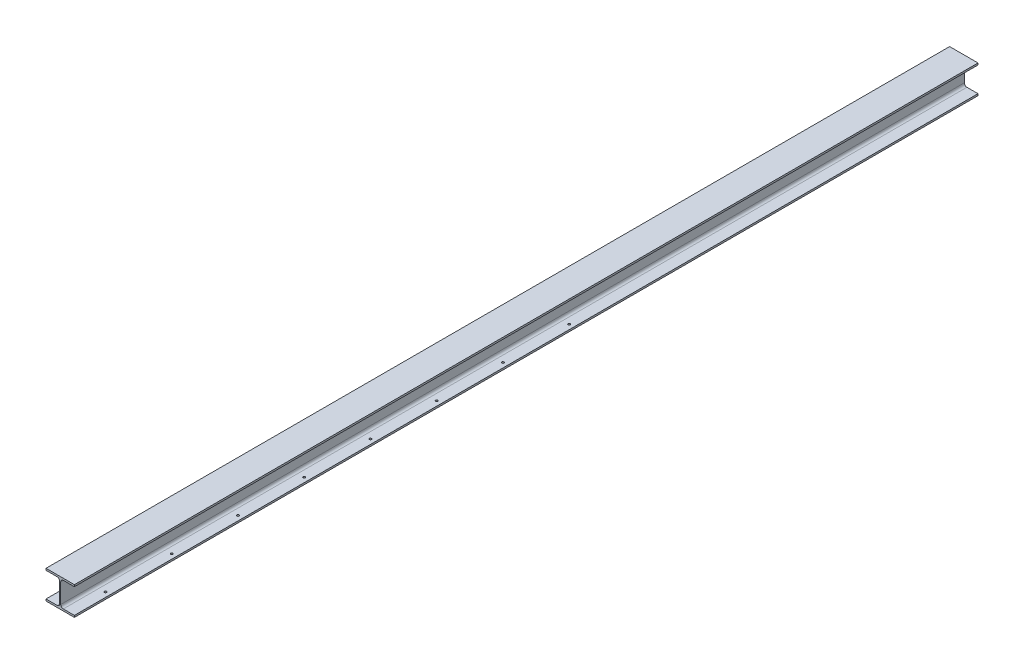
from build123d import *

# Parameters (mm, degrees)
EXTRUDE1_DEPTH             = 4775
CUT_EXTRUDE1_REACH         = 4788.766
SKETCH2_R                  = 11.000000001
LPATTERN1_COUNT            = 2
LPATTERN1_PITCH            = 250
LPATTERN1_COUNT_DIR2       = 2
LPATTERN1_PITCH_DIR2       = 200
LPATTERN2_COUNT            = 8
LPATTERN2_PITCH            = 700
LPATTERN2_COPY_1_REACH     = 4788.766
LPATTERN2_COPY_1_SKETCH_R  = 11.000000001
LPATTERN2_COPY_2_REACH     = 4788.766
LPATTERN2_COPY_2_SKETCH_R  = 11.000000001
LPATTERN2_COPY_3_REACH     = 4788.766
LPATTERN2_COPY_3_SKETCH_R  = 11.000000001
LPATTERN2_COPY_4_REACH     = 4788.766
LPATTERN2_COPY_4_SKETCH_R  = 11.000000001
LPATTERN2_COPY_5_REACH     = 4788.766
LPATTERN2_COPY_5_SKETCH_R  = 11.000000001
LPATTERN2_COPY_6_REACH     = 4788.766
LPATTERN2_COPY_6_SKETCH_R  = 11.000000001
LPATTERN2_COPY_7_REACH     = 4788.766
LPATTERN2_COPY_7_SKETCH_R  = 11.000000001
LPATTERN2_COPY_8_REACH     = 4788.766
LPATTERN2_COPY_8_SKETCH_R  = 11.000000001
LPATTERN2_COPY_9_REACH     = 4788.766
LPATTERN2_COPY_9_SKETCH_R  = 11.000000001
LPATTERN2_COPY_10_REACH    = 4788.766
LPATTERN2_COPY_10_SKETCH_R = 11.000000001
LPATTERN2_COPY_11_REACH    = 4788.766
LPATTERN2_COPY_11_SKETCH_R = 11.000000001
LPATTERN2_COPY_12_REACH    = 4788.766
LPATTERN2_COPY_12_SKETCH_R = 11.000000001
LPATTERN2_COPY_13_REACH    = 4788.766
LPATTERN2_COPY_13_SKETCH_R = 11.000000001
LPATTERN2_COPY_14_REACH    = 4788.766
LPATTERN2_COPY_14_SKETCH_R = 11.000000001


with BuildPart() as part:
    # Sketch1 → Extrude1 (new, symmetric)
    with BuildSketch(Plane.XY):
        with BuildLine():
            Line((-150, 0), (150, 0))
            Line((150, 0), (150, 19))
            Line((150, 19), (32.5, 19))
            ThreePointArc((32.5, 19), (13.408116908, 26.908116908), (5.5, 46))
            Line((5.5, 46), (5.5, 254))
            ThreePointArc((5.5, 254), (13.408116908, 273.091883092), (32.5, 281))
            Line((32.5, 281), (150, 281))
            Line((150, 281), (150, 300))
            Line((150, 300), (-150, 300))
            Line((-150, 300), (-150, 281))
            Line((-150, 281), (-32.5, 281))
            ThreePointArc((-32.5, 281), (-13.408116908, 273.091883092), (-5.5, 254))
            Line((-5.5, 254), (-5.5, 46))
            ThreePointArc((-5.5, 46), (-13.408116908, 26.908116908), (-32.5, 19))
            Line((-32.5, 19), (-150, 19))
            Line((-150, 19), (-150, 0))
        make_face()
    extrude(amount=EXTRUDE1_DEPTH, both=True)

    # Sketch2 → Cut-Extrude1 (cut, up to next)
    with BuildSketch(Plane.XZ, mode=Mode.PRIVATE) as cut_extrude1_sk1:
        with Locations((-100, 4645.99807559)):
            Circle(SKETCH2_R)
    cut_extrude1_tool1 = extrude(cut_extrude1_sk1.sketch, amount=-CUT_EXTRUDE1_REACH, mode=Mode.PRIVATE) & part.part
    cut_extrude1 = cut_extrude1_tool1.solids().sort_by_distance((-100, 0, 4645.998076))[0]
    add(cut_extrude1, mode=Mode.SUBTRACT)

    # LPattern1: Cut-Extrude1 2 × 2, 1 skipped
    with Locations(*[(j * LPATTERN1_PITCH_DIR2, 0, -i * LPATTERN1_PITCH) for i in range(LPATTERN1_COUNT) for j in range(LPATTERN1_COUNT_DIR2) if (i, j) not in ((0, 0), (0, 1))]):
        add(cut_extrude1, mode=Mode.SUBTRACT)

    # LPattern2: Cut-Extrude1 ×8
    with Locations(*[(0, 0, -i * LPATTERN2_PITCH) for i in range(1, LPATTERN2_COUNT)]):
        add(cut_extrude1, mode=Mode.SUBTRACT)

    # LPattern2 copy 1 sketch → LPattern2 copy 1 (cut, up to next)
    with BuildSketch(Plane(origin=(0, 0, -950), x_dir=(1, 0, 0), z_dir=(0, -1, 0)), mode=Mode.PRIVATE) as lpattern2_copy_1_sk1:
        with Locations((-100, 4645.99807559)):
            Circle(LPATTERN2_COPY_1_SKETCH_R)
    lpattern2_copy_1_tool1 = extrude(lpattern2_copy_1_sk1.sketch, amount=-LPATTERN2_COPY_1_REACH, mode=Mode.PRIVATE) & part.part
    add(lpattern2_copy_1_tool1.solids().sort_by_distance((-100, 0, 3695.998076))[0], mode=Mode.SUBTRACT)

    # LPattern2 copy 2 sketch → LPattern2 copy 2 (cut, up to next)
    with BuildSketch(Plane(origin=(0, 0, -1650), x_dir=(1, 0, 0), z_dir=(0, -1, 0)), mode=Mode.PRIVATE) as lpattern2_copy_2_sk1:
        with Locations((-100, 4645.99807559)):
            Circle(LPATTERN2_COPY_2_SKETCH_R)
    lpattern2_copy_2_tool1 = extrude(lpattern2_copy_2_sk1.sketch, amount=-LPATTERN2_COPY_2_REACH, mode=Mode.PRIVATE) & part.part
    add(lpattern2_copy_2_tool1.solids().sort_by_distance((-100, 0, 2995.998076))[0], mode=Mode.SUBTRACT)

    # LPattern2 copy 3 sketch → LPattern2 copy 3 (cut, up to next)
    with BuildSketch(Plane(origin=(0, 0, -2350), x_dir=(1, 0, 0), z_dir=(0, -1, 0)), mode=Mode.PRIVATE) as lpattern2_copy_3_sk1:
        with Locations((-100, 4645.99807559)):
            Circle(LPATTERN2_COPY_3_SKETCH_R)
    lpattern2_copy_3_tool1 = extrude(lpattern2_copy_3_sk1.sketch, amount=-LPATTERN2_COPY_3_REACH, mode=Mode.PRIVATE) & part.part
    add(lpattern2_copy_3_tool1.solids().sort_by_distance((-100, 0, 2295.998076))[0], mode=Mode.SUBTRACT)

    # LPattern2 copy 4 sketch → LPattern2 copy 4 (cut, up to next)
    with BuildSketch(Plane(origin=(0, 0, -3050), x_dir=(1, 0, 0), z_dir=(0, -1, 0)), mode=Mode.PRIVATE) as lpattern2_copy_4_sk1:
        with Locations((-100, 4645.99807559)):
            Circle(LPATTERN2_COPY_4_SKETCH_R)
    lpattern2_copy_4_tool1 = extrude(lpattern2_copy_4_sk1.sketch, amount=-LPATTERN2_COPY_4_REACH, mode=Mode.PRIVATE) & part.part
    add(lpattern2_copy_4_tool1.solids().sort_by_distance((-100, 0, 1595.998076))[0], mode=Mode.SUBTRACT)

    # LPattern2 copy 5 sketch → LPattern2 copy 5 (cut, up to next)
    with BuildSketch(Plane(origin=(0, 0, -3750), x_dir=(1, 0, 0), z_dir=(0, -1, 0)), mode=Mode.PRIVATE) as lpattern2_copy_5_sk1:
        with Locations((-100, 4645.99807559)):
            Circle(LPATTERN2_COPY_5_SKETCH_R)
    lpattern2_copy_5_tool1 = extrude(lpattern2_copy_5_sk1.sketch, amount=-LPATTERN2_COPY_5_REACH, mode=Mode.PRIVATE) & part.part
    add(lpattern2_copy_5_tool1.solids().sort_by_distance((-100, 0, 895.998076))[0], mode=Mode.SUBTRACT)

    # LPattern2 copy 6 sketch → LPattern2 copy 6 (cut, up to next)
    with BuildSketch(Plane(origin=(0, 0, -4450), x_dir=(1, 0, 0), z_dir=(0, -1, 0)), mode=Mode.PRIVATE) as lpattern2_copy_6_sk1:
        with Locations((-100, 4645.99807559)):
            Circle(LPATTERN2_COPY_6_SKETCH_R)
    lpattern2_copy_6_tool1 = extrude(lpattern2_copy_6_sk1.sketch, amount=-LPATTERN2_COPY_6_REACH, mode=Mode.PRIVATE) & part.part
    add(lpattern2_copy_6_tool1.solids().sort_by_distance((-100, 0, 195.998076))[0], mode=Mode.SUBTRACT)

    # LPattern2 copy 7 sketch → LPattern2 copy 7 (cut, up to next)
    with BuildSketch(Plane(origin=(0, 0, -5150), x_dir=(1, 0, 0), z_dir=(0, -1, 0)), mode=Mode.PRIVATE) as lpattern2_copy_7_sk1:
        with Locations((-100, 4645.99807559)):
            Circle(LPATTERN2_COPY_7_SKETCH_R)
    lpattern2_copy_7_tool1 = extrude(lpattern2_copy_7_sk1.sketch, amount=-LPATTERN2_COPY_7_REACH, mode=Mode.PRIVATE) & part.part
    add(lpattern2_copy_7_tool1.solids().sort_by_distance((-100, 0, -504.001924))[0], mode=Mode.SUBTRACT)

    # LPattern2 copy 8 sketch → LPattern2 copy 8 (cut, up to next)
    with BuildSketch(Plane(origin=(200, 0, -950), x_dir=(1, 0, 0), z_dir=(0, -1, 0)), mode=Mode.PRIVATE) as lpattern2_copy_8_sk1:
        with Locations((-100, 4645.99807559)):
            Circle(LPATTERN2_COPY_8_SKETCH_R)
    lpattern2_copy_8_tool1 = extrude(lpattern2_copy_8_sk1.sketch, amount=-LPATTERN2_COPY_8_REACH, mode=Mode.PRIVATE) & part.part
    add(lpattern2_copy_8_tool1.solids().sort_by_distance((100, 0, 3695.998076))[0], mode=Mode.SUBTRACT)

    # LPattern2 copy 9 sketch → LPattern2 copy 9 (cut, up to next)
    with BuildSketch(Plane(origin=(200, 0, -1650), x_dir=(1, 0, 0), z_dir=(0, -1, 0)), mode=Mode.PRIVATE) as lpattern2_copy_9_sk1:
        with Locations((-100, 4645.99807559)):
            Circle(LPATTERN2_COPY_9_SKETCH_R)
    lpattern2_copy_9_tool1 = extrude(lpattern2_copy_9_sk1.sketch, amount=-LPATTERN2_COPY_9_REACH, mode=Mode.PRIVATE) & part.part
    add(lpattern2_copy_9_tool1.solids().sort_by_distance((100, 0, 2995.998076))[0], mode=Mode.SUBTRACT)

    # LPattern2 copy 10 sketch → LPattern2 copy 10 (cut, up to next)
    with BuildSketch(Plane(origin=(200, 0, -2350), x_dir=(1, 0, 0), z_dir=(0, -1, 0)), mode=Mode.PRIVATE) as lpattern2_copy_10_sk1:
        with Locations((-100, 4645.99807559)):
            Circle(LPATTERN2_COPY_10_SKETCH_R)
    lpattern2_copy_10_tool1 = extrude(lpattern2_copy_10_sk1.sketch, amount=-LPATTERN2_COPY_10_REACH, mode=Mode.PRIVATE) & part.part
    add(lpattern2_copy_10_tool1.solids().sort_by_distance((100, 0, 2295.998076))[0], mode=Mode.SUBTRACT)

    # LPattern2 copy 11 sketch → LPattern2 copy 11 (cut, up to next)
    with BuildSketch(Plane(origin=(200, 0, -3050), x_dir=(1, 0, 0), z_dir=(0, -1, 0)), mode=Mode.PRIVATE) as lpattern2_copy_11_sk1:
        with Locations((-100, 4645.99807559)):
            Circle(LPATTERN2_COPY_11_SKETCH_R)
    lpattern2_copy_11_tool1 = extrude(lpattern2_copy_11_sk1.sketch, amount=-LPATTERN2_COPY_11_REACH, mode=Mode.PRIVATE) & part.part
    add(lpattern2_copy_11_tool1.solids().sort_by_distance((100, 0, 1595.998076))[0], mode=Mode.SUBTRACT)

    # LPattern2 copy 12 sketch → LPattern2 copy 12 (cut, up to next)
    with BuildSketch(Plane(origin=(200, 0, -3750), x_dir=(1, 0, 0), z_dir=(0, -1, 0)), mode=Mode.PRIVATE) as lpattern2_copy_12_sk1:
        with Locations((-100, 4645.99807559)):
            Circle(LPATTERN2_COPY_12_SKETCH_R)
    lpattern2_copy_12_tool1 = extrude(lpattern2_copy_12_sk1.sketch, amount=-LPATTERN2_COPY_12_REACH, mode=Mode.PRIVATE) & part.part
    add(lpattern2_copy_12_tool1.solids().sort_by_distance((100, 0, 895.998076))[0], mode=Mode.SUBTRACT)

    # LPattern2 copy 13 sketch → LPattern2 copy 13 (cut, up to next)
    with BuildSketch(Plane(origin=(200, 0, -4450), x_dir=(1, 0, 0), z_dir=(0, -1, 0)), mode=Mode.PRIVATE) as lpattern2_copy_13_sk1:
        with Locations((-100, 4645.99807559)):
            Circle(LPATTERN2_COPY_13_SKETCH_R)
    lpattern2_copy_13_tool1 = extrude(lpattern2_copy_13_sk1.sketch, amount=-LPATTERN2_COPY_13_REACH, mode=Mode.PRIVATE) & part.part
    add(lpattern2_copy_13_tool1.solids().sort_by_distance((100, 0, 195.998076))[0], mode=Mode.SUBTRACT)

    # LPattern2 copy 14 sketch → LPattern2 copy 14 (cut, up to next)
    with BuildSketch(Plane(origin=(200, 0, -5150), x_dir=(1, 0, 0), z_dir=(0, -1, 0)), mode=Mode.PRIVATE) as lpattern2_copy_14_sk1:
        with Locations((-100, 4645.99807559)):
            Circle(LPATTERN2_COPY_14_SKETCH_R)
    lpattern2_copy_14_tool1 = extrude(lpattern2_copy_14_sk1.sketch, amount=-LPATTERN2_COPY_14_REACH, mode=Mode.PRIVATE) & part.part
    add(lpattern2_copy_14_tool1.solids().sort_by_distance((100, 0, -504.001924))[0], mode=Mode.SUBTRACT)


solid = part.part
